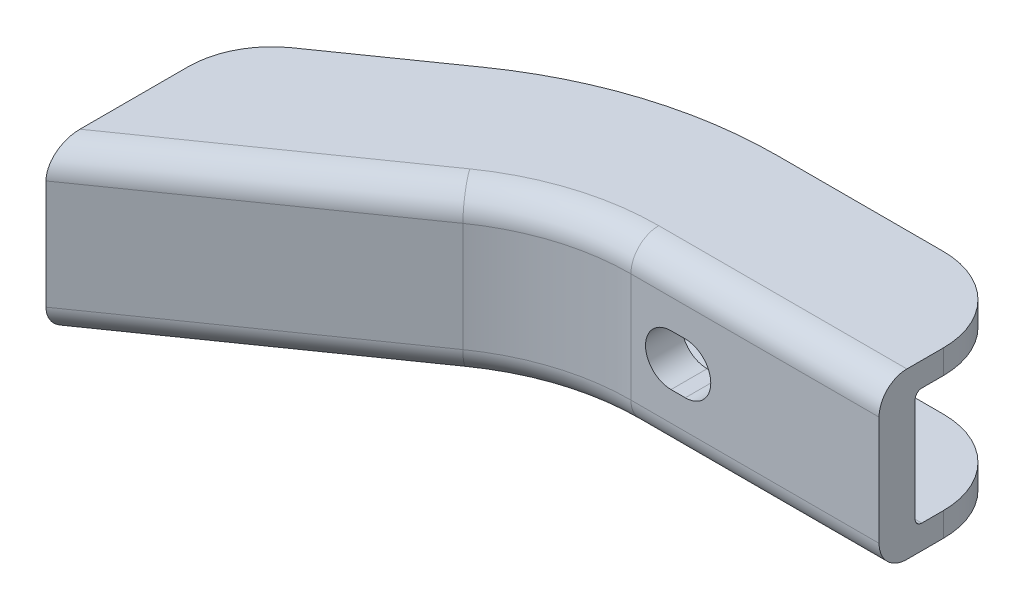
ISO-10303-21;
HEADER;
FILE_DESCRIPTION(('STEP AP214'),'2;1');
FILE_NAME('part.step','',(''),(''),'','','');
FILE_SCHEMA(('AUTOMOTIVE_DESIGN { 1 0 10303 214 1 1 1 1 }'));
ENDSEC;
DATA;
#1=APPLICATION_CONTEXT('core data for automotive mechanical design processes');
#2=APPLICATION_PROTOCOL_DEFINITION('international standard','automotive_design',2000,#1);
#3=PRODUCT_CONTEXT('',#1,'mechanical');
#4=PRODUCT('Part','Part','',(#3));
#5=PRODUCT_RELATED_PRODUCT_CATEGORY('part','',(#4));
#6=PRODUCT_DEFINITION_FORMATION('','',#4);
#7=PRODUCT_DEFINITION_CONTEXT('part definition',#1,'design');
#8=PRODUCT_DEFINITION('design','',#6,#7);
#9=PRODUCT_DEFINITION_SHAPE('','',#8);
#10=(LENGTH_UNIT() NAMED_UNIT(*) SI_UNIT(.MILLI.,.METRE.));
#11=(NAMED_UNIT(*) PLANE_ANGLE_UNIT() SI_UNIT($,.RADIAN.));
#12=(NAMED_UNIT(*) SI_UNIT($,.STERADIAN.) SOLID_ANGLE_UNIT());
#13=UNCERTAINTY_MEASURE_WITH_UNIT(LENGTH_MEASURE(1.E-05),#10,'distance_accuracy_value','');
#14=(GEOMETRIC_REPRESENTATION_CONTEXT(3) GLOBAL_UNCERTAINTY_ASSIGNED_CONTEXT((#13)) GLOBAL_UNIT_ASSIGNED_CONTEXT((#10,
#11,#12)) REPRESENTATION_CONTEXT('',''));
#15=CARTESIAN_POINT('',(0.,0.,0.));
#16=DIRECTION('',(0.,0.,1.));
#17=DIRECTION('',(1.,0.,0.));
#18=AXIS2_PLACEMENT_3D('',#15,#16,#17);
#19=CARTESIAN_POINT('',(0.,2.7432,-7.34059999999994));
#20=DIRECTION('',(-1.,0.,0.));
#21=DIRECTION('',(0.,0.,1.));
#22=AXIS2_PLACEMENT_3D('',#19,#20,#21);
#23=PLANE('',#22);
#24=DIRECTION('',(0.,-1.,0.));
#25=VECTOR('',#24,1.);
#26=CARTESIAN_POINT('',(0.,2.7432,0.));
#27=LINE('',#26,#25);
#28=CARTESIAN_POINT('',(0.,15.6464,0.));
#29=VERTEX_POINT('',#28);
#30=CARTESIAN_POINT('',(0.,3.175,0.));
#31=VERTEX_POINT('',#30);
#32=EDGE_CURVE('E360',#29,#31,#27,.T.);
#33=ORIENTED_EDGE('',*,*,#32,.T.);
#34=CARTESIAN_POINT('',(0.,3.175,-3.175));
#35=DIRECTION('',(-1.,0.,0.));
#36=DIRECTION('',(0.,0.,1.));
#37=AXIS2_PLACEMENT_3D('',#34,#35,#36);
#38=CIRCLE('',#37,3.175);
#39=CARTESIAN_POINT('',(0.,0.,-3.175));
#40=VERTEX_POINT('',#39);
#41=EDGE_CURVE('E456',#31,#40,#38,.F.);
#42=ORIENTED_EDGE('',*,*,#41,.T.);
#43=DIRECTION('',(0.,0.,-1.));
#44=VECTOR('',#43,1.);
#45=CARTESIAN_POINT('',(0.,0.,-7.34059999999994));
#46=LINE('',#45,#44);
#47=CARTESIAN_POINT('',(0.,0.,-7.34059999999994));
#48=VERTEX_POINT('',#47);
#49=EDGE_CURVE('E343',#40,#48,#46,.T.);
#50=ORIENTED_EDGE('',*,*,#49,.T.);
#51=DIRECTION('',(0.,-1.,0.));
#52=VECTOR('',#51,1.);
#53=CARTESIAN_POINT('',(0.,2.7432,-7.34059999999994));
#54=LINE('',#53,#52);
#55=CARTESIAN_POINT('',(0.,2.7432,-7.34059999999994));
#56=VERTEX_POINT('',#55);
#57=EDGE_CURVE('E400',#56,#48,#54,.T.);
#58=ORIENTED_EDGE('',*,*,#57,.F.);
#59=DIRECTION('',(0.,0.,-1.));
#60=VECTOR('',#59,1.);
#61=CARTESIAN_POINT('',(0.,2.7432,-7.34059999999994));
#62=LINE('',#61,#60);
#63=CARTESIAN_POINT('',(0.,2.7432,-4.8768));
#64=VERTEX_POINT('',#63);
#65=EDGE_CURVE('E344',#64,#56,#62,.T.);
#66=ORIENTED_EDGE('',*,*,#65,.F.);
#67=CARTESIAN_POINT('',(0.,3.5052,-4.8768));
#68=DIRECTION('',(-1.,0.,0.));
#69=DIRECTION('',(0.,0.,1.));
#70=AXIS2_PLACEMENT_3D('',#67,#68,#69);
#71=CIRCLE('',#70,0.762);
#72=CARTESIAN_POINT('',(0.,3.5052,-4.1148));
#73=VERTEX_POINT('',#72);
#74=EDGE_CURVE('E433',#64,#73,#71,.T.);
#75=ORIENTED_EDGE('',*,*,#74,.T.);
#76=DIRECTION('',(0.,-1.,0.));
#77=VECTOR('',#76,1.);
#78=CARTESIAN_POINT('',(0.,16.0782,-4.1148));
#79=LINE('',#78,#77);
#80=CARTESIAN_POINT('',(0.,15.3162,-4.1148));
#81=VERTEX_POINT('',#80);
#82=EDGE_CURVE('E340',#81,#73,#79,.T.);
#83=ORIENTED_EDGE('',*,*,#82,.F.);
#84=CARTESIAN_POINT('',(0.,15.3162,-4.8768));
#85=DIRECTION('',(-1.,0.,0.));
#86=DIRECTION('',(0.,0.,1.));
#87=AXIS2_PLACEMENT_3D('',#84,#85,#86);
#88=CIRCLE('',#87,0.762);
#89=CARTESIAN_POINT('',(0.,16.0782,-4.8768));
#90=VERTEX_POINT('',#89);
#91=EDGE_CURVE('E435',#81,#90,#88,.T.);
#92=ORIENTED_EDGE('',*,*,#91,.T.);
#93=DIRECTION('',(0.,0.,-1.));
#94=VECTOR('',#93,1.);
#95=CARTESIAN_POINT('',(0.,16.0782,0.));
#96=LINE('',#95,#94);
#97=CARTESIAN_POINT('',(0.,16.0782,-7.34059999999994));
#98=VERTEX_POINT('',#97);
#99=EDGE_CURVE('E299',#90,#98,#96,.T.);
#100=ORIENTED_EDGE('',*,*,#99,.T.);
#101=DIRECTION('',(0.,-1.,0.));
#102=VECTOR('',#101,1.);
#103=CARTESIAN_POINT('',(0.,18.8214,-7.34059999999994));
#104=LINE('',#103,#102);
#105=CARTESIAN_POINT('',(0.,18.8214,-7.34059999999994));
#106=VERTEX_POINT('',#105);
#107=EDGE_CURVE('E328',#106,#98,#104,.T.);
#108=ORIENTED_EDGE('',*,*,#107,.F.);
#109=DIRECTION('',(0.,0.,-1.));
#110=VECTOR('',#109,1.);
#111=CARTESIAN_POINT('',(0.,18.8214,0.));
#112=LINE('',#111,#110);
#113=CARTESIAN_POINT('',(0.,18.8214,-3.175));
#114=VERTEX_POINT('',#113);
#115=EDGE_CURVE('E282',#114,#106,#112,.T.);
#116=ORIENTED_EDGE('',*,*,#115,.F.);
#117=CARTESIAN_POINT('',(0.,15.6464,-3.175));
#118=DIRECTION('',(-1.,0.,0.));
#119=DIRECTION('',(0.,0.,1.));
#120=AXIS2_PLACEMENT_3D('',#117,#118,#119);
#121=CIRCLE('',#120,3.175);
#122=EDGE_CURVE('E454',#114,#29,#121,.F.);
#123=ORIENTED_EDGE('',*,*,#122,.T.);
#124=EDGE_LOOP('',(#33,#42,#50,#58,#66,#75,#83,#92,#100,#108,#116,#123));
#125=FACE_BOUND('',#124,.T.);
#126=ADVANCED_FACE('F34',(#125),#23,.F.);
#127=CARTESIAN_POINT('',(-9.525,2.7432,-7.34060000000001));
#128=DIRECTION('',(0.,-1.,0.));
#129=DIRECTION('',(0.,0.,-1.));
#130=AXIS2_PLACEMENT_3D('',#127,#128,#129);
#131=CYLINDRICAL_SURFACE('',#130,9.525);
#132=CARTESIAN_POINT('',(-9.525,0.,-7.34060000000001));
#133=DIRECTION('',(0.,1.,0.));
#134=DIRECTION('',(0.,0.,-1.));
#135=AXIS2_PLACEMENT_3D('',#132,#133,#134);
#136=CIRCLE('',#135,9.525);
#137=CARTESIAN_POINT('',(-9.52500000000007,0.,-16.8656));
#138=VERTEX_POINT('',#137);
#139=EDGE_CURVE('E362',#48,#138,#136,.T.);
#140=ORIENTED_EDGE('',*,*,#139,.T.);
#141=DIRECTION('',(0.,-1.,0.));
#142=VECTOR('',#141,1.);
#143=CARTESIAN_POINT('',(-9.52500000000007,2.7432,-16.8656));
#144=LINE('',#143,#142);
#145=CARTESIAN_POINT('',(-9.52500000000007,2.7432,-16.8656));
#146=VERTEX_POINT('',#145);
#147=EDGE_CURVE('E397',#146,#138,#144,.T.);
#148=ORIENTED_EDGE('',*,*,#147,.F.);
#149=CARTESIAN_POINT('',(-9.525,2.7432,-7.34060000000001));
#150=DIRECTION('',(0.,1.,0.));
#151=DIRECTION('',(0.,0.,-1.));
#152=AXIS2_PLACEMENT_3D('',#149,#150,#151);
#153=CIRCLE('',#152,9.525);
#154=EDGE_CURVE('E346',#56,#146,#153,.T.);
#155=ORIENTED_EDGE('',*,*,#154,.F.);
#156=ORIENTED_EDGE('',*,*,#57,.T.);
#157=EDGE_LOOP('',(#140,#148,#155,#156));
#158=FACE_BOUND('',#157,.T.);
#159=ADVANCED_FACE('F570',(#158),#131,.T.);
#160=CARTESIAN_POINT('',(-28.4660595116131,2.7432,-16.8656));
#161=DIRECTION('',(0.,0.,1.));
#162=DIRECTION('',(1.,0.,0.));
#163=AXIS2_PLACEMENT_3D('',#160,#161,#162);
#164=PLANE('',#163);
#165=DIRECTION('',(-1.,0.,0.));
#166=VECTOR('',#165,1.);
#167=CARTESIAN_POINT('',(-28.4660595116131,0.,-16.8656));
#168=LINE('',#167,#166);
#169=CARTESIAN_POINT('',(-28.4660595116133,0.,-16.8656));
#170=VERTEX_POINT('',#169);
#171=EDGE_CURVE('E364',#138,#170,#168,.T.);
#172=ORIENTED_EDGE('',*,*,#171,.T.);
#173=DIRECTION('',(0.,-1.,0.));
#174=VECTOR('',#173,1.);
#175=CARTESIAN_POINT('',(-28.4660595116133,2.7432,-16.8656));
#176=LINE('',#175,#174);
#177=CARTESIAN_POINT('',(-28.4660595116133,2.7432,-16.8656));
#178=VERTEX_POINT('',#177);
#179=EDGE_CURVE('E394',#178,#170,#176,.T.);
#180=ORIENTED_EDGE('',*,*,#179,.F.);
#181=DIRECTION('',(-1.,0.,0.));
#182=VECTOR('',#181,1.);
#183=CARTESIAN_POINT('',(-28.4660595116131,2.7432,-16.8656));
#184=LINE('',#183,#182);
#185=EDGE_CURVE('E349',#146,#178,#184,.T.);
#186=ORIENTED_EDGE('',*,*,#185,.F.);
#187=ORIENTED_EDGE('',*,*,#147,.T.);
#188=EDGE_LOOP('',(#172,#180,#186,#187));
#189=FACE_BOUND('',#188,.T.);
#190=ADVANCED_FACE('F627',(#189),#164,.F.);
#191=CARTESIAN_POINT('',(-28.4660595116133,2.7432,27.5844));
#192=DIRECTION('',(0.,-1.,0.));
#193=DIRECTION('',(0.,0.,-1.));
#194=AXIS2_PLACEMENT_3D('',#191,#192,#193);
#195=CYLINDRICAL_SURFACE('',#194,44.45);
#196=CARTESIAN_POINT('',(-28.4660595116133,0.,27.5844));
#197=DIRECTION('',(0.,1.,0.));
#198=DIRECTION('',(0.,0.,-1.));
#199=AXIS2_PLACEMENT_3D('',#196,#197,#198);
#200=CIRCLE('',#199,44.45);
#201=CARTESIAN_POINT('',(-53.9615321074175,0.,-8.82690836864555));
#202=VERTEX_POINT('',#201);
#203=EDGE_CURVE('E366',#170,#202,#200,.T.);
#204=ORIENTED_EDGE('',*,*,#203,.T.);
#205=DIRECTION('',(0.,-1.,0.));
#206=VECTOR('',#205,1.);
#207=CARTESIAN_POINT('',(-53.9615321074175,2.7432,-8.82690836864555));
#208=LINE('',#207,#206);
#209=CARTESIAN_POINT('',(-53.9615321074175,2.7432,-8.82690836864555));
#210=VERTEX_POINT('',#209);
#211=EDGE_CURVE('E391',#210,#202,#208,.T.);
#212=ORIENTED_EDGE('',*,*,#211,.F.);
#213=CARTESIAN_POINT('',(-28.4660595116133,2.7432,27.5844));
#214=DIRECTION('',(0.,1.,0.));
#215=DIRECTION('',(0.,0.,-1.));
#216=AXIS2_PLACEMENT_3D('',#213,#214,#215);
#217=CIRCLE('',#216,44.45);
#218=EDGE_CURVE('E351',#178,#210,#217,.T.);
#219=ORIENTED_EDGE('',*,*,#218,.F.);
#220=ORIENTED_EDGE('',*,*,#179,.T.);
#221=EDGE_LOOP('',(#204,#212,#219,#220));
#222=FACE_BOUND('',#221,.T.);
#223=ADVANCED_FACE('F623',(#222),#195,.T.);
#224=CARTESIAN_POINT('',(-66.7990423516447,2.7432,0.162013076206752));
#225=DIRECTION('',(0.573576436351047,0.,0.819152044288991));
#226=DIRECTION('',(0.819152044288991,0.,-0.573576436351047));
#227=AXIS2_PLACEMENT_3D('',#224,#225,#226);
#228=PLANE('',#227);
#229=DIRECTION('',(-0.819152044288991,0.,0.573576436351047));
#230=VECTOR('',#229,1.);
#231=CARTESIAN_POINT('',(-66.7990423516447,0.,0.162013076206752));
#232=LINE('',#231,#230);
#233=CARTESIAN_POINT('',(-66.7990423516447,0.,0.162013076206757));
#234=VERTEX_POINT('',#233);
#235=EDGE_CURVE('E368',#202,#234,#232,.T.);
#236=ORIENTED_EDGE('',*,*,#235,.T.);
#237=DIRECTION('',(0.,-1.,0.));
#238=VECTOR('',#237,1.);
#239=CARTESIAN_POINT('',(-66.7990423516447,2.7432,0.162013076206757));
#240=LINE('',#239,#238);
#241=CARTESIAN_POINT('',(-66.7990423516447,2.7432,0.162013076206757));
#242=VERTEX_POINT('',#241);
#243=EDGE_CURVE('E388',#242,#234,#240,.T.);
#244=ORIENTED_EDGE('',*,*,#243,.F.);
#245=DIRECTION('',(-0.819152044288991,0.,0.573576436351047));
#246=VECTOR('',#245,1.);
#247=CARTESIAN_POINT('',(-66.7990423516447,2.7432,0.162013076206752));
#248=LINE('',#247,#246);
#249=EDGE_CURVE('E353',#210,#242,#248,.T.);
#250=ORIENTED_EDGE('',*,*,#249,.F.);
#251=ORIENTED_EDGE('',*,*,#211,.T.);
#252=EDGE_LOOP('',(#236,#244,#250,#251));
#253=FACE_BOUND('',#252,.T.);
#254=ADVANCED_FACE('F619',(#253),#228,.F.);
#255=CARTESIAN_POINT('',(-61.335726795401,2.7432,7.96443629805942));
#256=DIRECTION('',(0.,-1.,0.));
#257=DIRECTION('',(0.,0.,-1.));
#258=AXIS2_PLACEMENT_3D('',#255,#256,#257);
#259=CYLINDRICAL_SURFACE('',#258,9.525);
#260=CARTESIAN_POINT('',(-61.335726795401,0.,7.96443629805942));
#261=DIRECTION('',(0.,1.,0.));
#262=DIRECTION('',(0.,0.,-1.));
#263=AXIS2_PLACEMENT_3D('',#260,#261,#262);
#264=CIRCLE('',#263,9.525);
#265=CARTESIAN_POINT('',(-70.860726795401,0.,7.96443629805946));
#266=VERTEX_POINT('',#265);
#267=EDGE_CURVE('E370',#234,#266,#264,.T.);
#268=ORIENTED_EDGE('',*,*,#267,.T.);
#269=DIRECTION('',(0.,-1.,0.));
#270=VECTOR('',#269,1.);
#271=CARTESIAN_POINT('',(-70.860726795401,2.7432,7.96443629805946));
#272=LINE('',#271,#270);
#273=CARTESIAN_POINT('',(-70.860726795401,2.7432,7.96443629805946));
#274=VERTEX_POINT('',#273);
#275=EDGE_CURVE('E385',#274,#266,#272,.T.);
#276=ORIENTED_EDGE('',*,*,#275,.F.);
#277=CARTESIAN_POINT('',(-61.335726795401,2.7432,7.96443629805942));
#278=DIRECTION('',(0.,1.,0.));
#279=DIRECTION('',(0.,0.,-1.));
#280=AXIS2_PLACEMENT_3D('',#277,#278,#279);
#281=CIRCLE('',#280,9.525);
#282=EDGE_CURVE('E355',#242,#274,#281,.T.);
#283=ORIENTED_EDGE('',*,*,#282,.F.);
#284=ORIENTED_EDGE('',*,*,#243,.T.);
#285=EDGE_LOOP('',(#268,#276,#283,#284));
#286=FACE_BOUND('',#285,.T.);
#287=ADVANCED_FACE('F614',(#286),#259,.T.);
#288=CARTESIAN_POINT('',(-70.860726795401,2.7432,24.1842768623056));
#289=DIRECTION('',(1.,0.,0.));
#290=DIRECTION('',(0.,0.,-1.));
#291=AXIS2_PLACEMENT_3D('',#288,#289,#290);
#292=PLANE('',#291);
#293=DIRECTION('',(0.,-1.,0.));
#294=VECTOR('',#293,1.);
#295=CARTESIAN_POINT('',(-70.860726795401,2.7432,24.1842768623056));
#296=LINE('',#295,#294);
#297=CARTESIAN_POINT('',(-70.860726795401,15.6464,24.1842768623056));
#298=VERTEX_POINT('',#297);
#299=CARTESIAN_POINT('',(-70.860726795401,3.175,24.1842768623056));
#300=VERTEX_POINT('',#299);
#301=EDGE_CURVE('E382',#298,#300,#296,.T.);
#302=ORIENTED_EDGE('',*,*,#301,.F.);
#303=CARTESIAN_POINT('',(-70.860726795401,15.6464,20.3083175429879));
#304=DIRECTION('',(1.,0.,0.));
#305=DIRECTION('',(0.,0.,1.));
#306=AXIS2_PLACEMENT_3D('',#303,#304,#305);
#307=ELLIPSE('',#306,3.87595931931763,3.175);
#308=CARTESIAN_POINT('',(-70.860726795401,18.8214,20.3083175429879));
#309=VERTEX_POINT('',#308);
#310=EDGE_CURVE('E11',#298,#309,#307,.F.);
#311=ORIENTED_EDGE('',*,*,#310,.T.);
#312=DIRECTION('',(0.,0.,1.));
#313=VECTOR('',#312,1.);
#314=CARTESIAN_POINT('',(-70.860726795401,18.8214,7.96443629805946));
#315=LINE('',#314,#313);
#316=CARTESIAN_POINT('',(-70.860726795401,18.8214,7.96443629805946));
#317=VERTEX_POINT('',#316);
#318=EDGE_CURVE('E295',#317,#309,#315,.T.);
#319=ORIENTED_EDGE('',*,*,#318,.F.);
#320=DIRECTION('',(0.,-1.,0.));
#321=VECTOR('',#320,1.);
#322=CARTESIAN_POINT('',(-70.860726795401,18.8214,7.96443629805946));
#323=LINE('',#322,#321);
#324=CARTESIAN_POINT('',(-70.860726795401,16.0782,7.96443629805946));
#325=VERTEX_POINT('',#324);
#326=EDGE_CURVE('E298',#317,#325,#323,.T.);
#327=ORIENTED_EDGE('',*,*,#326,.T.);
#328=DIRECTION('',(0.,0.,1.));
#329=VECTOR('',#328,1.);
#330=CARTESIAN_POINT('',(-70.860726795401,16.0782,7.96443629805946));
#331=LINE('',#330,#329);
#332=CARTESIAN_POINT('',(-70.860726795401,16.0782,18.2308033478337));
#333=VERTEX_POINT('',#332);
#334=EDGE_CURVE('E285',#325,#333,#331,.T.);
#335=ORIENTED_EDGE('',*,*,#334,.T.);
#336=CARTESIAN_POINT('',(-70.860726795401,15.3162,18.2308033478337));
#337=DIRECTION('',(1.,0.,0.));
#338=DIRECTION('',(0.,0.,-1.));
#339=AXIS2_PLACEMENT_3D('',#336,#337,#338);
#340=ELLIPSE('',#339,0.93023023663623,0.762);
#341=CARTESIAN_POINT('',(-70.860726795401,15.3162,19.1610335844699));
#342=VERTEX_POINT('',#341);
#343=EDGE_CURVE('E431',#333,#342,#340,.T.);
#344=ORIENTED_EDGE('',*,*,#343,.T.);
#345=DIRECTION('',(0.,-1.,0.));
#346=VECTOR('',#345,1.);
#347=CARTESIAN_POINT('',(-70.860726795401,16.0782,19.1610335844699));
#348=LINE('',#347,#346);
#349=CARTESIAN_POINT('',(-70.860726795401,3.5052,19.1610335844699));
#350=VERTEX_POINT('',#349);
#351=EDGE_CURVE('E331',#342,#350,#348,.T.);
#352=ORIENTED_EDGE('',*,*,#351,.T.);
#353=CARTESIAN_POINT('',(-70.860726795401,3.5052,18.2308033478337));
#354=DIRECTION('',(1.,0.,0.));
#355=DIRECTION('',(0.,0.,1.));
#356=AXIS2_PLACEMENT_3D('',#353,#354,#355);
#357=ELLIPSE('',#356,0.93023023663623,0.762);
#358=CARTESIAN_POINT('',(-70.860726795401,2.7432,18.2308033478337));
#359=VERTEX_POINT('',#358);
#360=EDGE_CURVE('E429',#350,#359,#357,.T.);
#361=ORIENTED_EDGE('',*,*,#360,.T.);
#362=DIRECTION('',(0.,0.,1.));
#363=VECTOR('',#362,1.);
#364=CARTESIAN_POINT('',(-70.860726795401,2.7432,24.1842768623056));
#365=LINE('',#364,#363);
#366=EDGE_CURVE('E357',#274,#359,#365,.T.);
#367=ORIENTED_EDGE('',*,*,#366,.F.);
#368=ORIENTED_EDGE('',*,*,#275,.T.);
#369=DIRECTION('',(0.,0.,1.));
#370=VECTOR('',#369,1.);
#371=CARTESIAN_POINT('',(-70.860726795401,0.,24.1842768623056));
#372=LINE('',#371,#370);
#373=CARTESIAN_POINT('',(-70.860726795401,0.,20.3083175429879));
#374=VERTEX_POINT('',#373);
#375=EDGE_CURVE('E347',#266,#374,#372,.T.);
#376=ORIENTED_EDGE('',*,*,#375,.T.);
#377=CARTESIAN_POINT('',(-70.860726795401,3.175,20.3083175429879));
#378=DIRECTION('',(1.,0.,0.));
#379=DIRECTION('',(0.,0.,-1.));
#380=AXIS2_PLACEMENT_3D('',#377,#378,#379);
#381=ELLIPSE('',#380,3.87595931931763,3.175);
#382=EDGE_CURVE('E43',#374,#300,#381,.F.);
#383=ORIENTED_EDGE('',*,*,#382,.T.);
#384=EDGE_LOOP('',(#302,#311,#319,#327,#335,#344,#352,#361,#367,#368,#376,#383));
#385=FACE_BOUND('',#384,.T.);
#386=ADVANCED_FACE('F534',(#385),#292,.F.);
#387=CARTESIAN_POINT('',(-42.8822522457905,2.7432,4.59353807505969));
#388=DIRECTION('',(-0.573576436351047,0.,-0.819152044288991));
#389=DIRECTION('',(-0.819152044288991,0.,0.573576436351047));
#390=AXIS2_PLACEMENT_3D('',#387,#388,#389);
#391=PLANE('',#390);
#392=DIRECTION('',(0.,-1.,0.));
#393=VECTOR('',#392,1.);
#394=CARTESIAN_POINT('',(-42.8822522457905,2.7432,4.59353807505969));
#395=LINE('',#394,#393);
#396=CARTESIAN_POINT('',(-42.8822522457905,15.6464,4.59353807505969));
#397=VERTEX_POINT('',#396);
#398=CARTESIAN_POINT('',(-42.8822522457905,3.175,4.59353807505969));
#399=VERTEX_POINT('',#398);
#400=EDGE_CURVE('E379',#397,#399,#395,.T.);
#401=ORIENTED_EDGE('',*,*,#400,.F.);
#402=DIRECTION('',(0.819152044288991,0.,-0.573576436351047));
#403=VECTOR('',#402,1.);
#404=CARTESIAN_POINT('',(-70.860726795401,15.6464,24.1842768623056));
#405=LINE('',#404,#403);
#406=EDGE_CURVE('E477',#397,#298,#405,.F.);
#407=ORIENTED_EDGE('',*,*,#406,.T.);
#408=ORIENTED_EDGE('',*,*,#301,.T.);
#409=DIRECTION('',(0.819152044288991,0.,-0.573576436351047));
#410=VECTOR('',#409,1.);
#411=CARTESIAN_POINT('',(-42.8822522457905,3.175,4.59353807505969));
#412=LINE('',#411,#410);
#413=EDGE_CURVE('E475',#300,#399,#412,.T.);
#414=ORIENTED_EDGE('',*,*,#413,.T.);
#415=EDGE_LOOP('',(#401,#407,#408,#414));
#416=FACE_BOUND('',#415,.T.);
#417=ADVANCED_FACE('F539',(#416),#391,.F.);
#418=CARTESIAN_POINT('',(-28.3134107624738,2.7432,25.4));
#419=DIRECTION('',(0.,-1.,0.));
#420=DIRECTION('',(0.,0.,-1.));
#421=AXIS2_PLACEMENT_3D('',#418,#419,#420);
#422=CYLINDRICAL_SURFACE('',#421,25.4);
#423=ORIENTED_EDGE('',*,*,#400,.T.);
#424=CARTESIAN_POINT('',(-28.3134107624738,3.175,25.4));
#425=DIRECTION('',(0.,1.,0.));
#426=DIRECTION('',(0.,0.,1.));
#427=AXIS2_PLACEMENT_3D('',#424,#425,#426);
#428=CIRCLE('',#427,25.4);
#429=CARTESIAN_POINT('',(-28.3134107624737,3.175,0.));
#430=VERTEX_POINT('',#429);
#431=EDGE_CURVE('E466',#399,#430,#428,.F.);
#432=ORIENTED_EDGE('',*,*,#431,.T.);
#433=DIRECTION('',(0.,-1.,0.));
#434=VECTOR('',#433,1.);
#435=CARTESIAN_POINT('',(-28.3134107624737,2.7432,0.));
#436=LINE('',#435,#434);
#437=CARTESIAN_POINT('',(-28.3134107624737,15.6464,0.));
#438=VERTEX_POINT('',#437);
#439=EDGE_CURVE('E376',#438,#430,#436,.T.);
#440=ORIENTED_EDGE('',*,*,#439,.F.);
#441=CARTESIAN_POINT('',(-28.3134107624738,15.6464,25.4));
#442=DIRECTION('',(0.,1.,0.));
#443=DIRECTION('',(0.,0.,1.));
#444=AXIS2_PLACEMENT_3D('',#441,#442,#443);
#445=CIRCLE('',#444,25.4);
#446=EDGE_CURVE('E464',#438,#397,#445,.T.);
#447=ORIENTED_EDGE('',*,*,#446,.T.);
#448=EDGE_LOOP('',(#423,#432,#440,#447));
#449=FACE_BOUND('',#448,.T.);
#450=ADVANCED_FACE('F543',(#449),#422,.F.);
#451=CARTESIAN_POINT('',(0.,2.7432,0.));
#452=DIRECTION('',(0.,0.,-1.));
#453=DIRECTION('',(-1.,0.,0.));
#454=AXIS2_PLACEMENT_3D('',#451,#452,#453);
#455=PLANE('',#454);
#456=DIRECTION('',(1.,0.,0.));
#457=VECTOR('',#456,1.);
#458=CARTESIAN_POINT('',(0.,12.319,0.));
#459=LINE('',#458,#457);
#460=CARTESIAN_POINT('',(-23.7363,12.319,0.));
#461=VERTEX_POINT('',#460);
#462=CARTESIAN_POINT('',(-22.1107,12.319,0.));
#463=VERTEX_POINT('',#462);
#464=EDGE_CURVE('E275',#461,#463,#459,.T.);
#465=ORIENTED_EDGE('',*,*,#464,.T.);
#466=CARTESIAN_POINT('',(-22.1107,9.4107,0.));
#467=DIRECTION('',(0.,0.,-1.));
#468=DIRECTION('',(-1.,0.,0.));
#469=AXIS2_PLACEMENT_3D('',#466,#467,#468);
#470=CIRCLE('',#469,2.9083);
#471=CARTESIAN_POINT('',(-22.1107,6.5024,0.));
#472=VERTEX_POINT('',#471);
#473=EDGE_CURVE('E278',#463,#472,#470,.T.);
#474=ORIENTED_EDGE('',*,*,#473,.T.);
#475=DIRECTION('',(-1.,0.,0.));
#476=VECTOR('',#475,1.);
#477=CARTESIAN_POINT('',(0.,6.5024,0.));
#478=LINE('',#477,#476);
#479=CARTESIAN_POINT('',(-23.7363,6.5024,0.));
#480=VERTEX_POINT('',#479);
#481=EDGE_CURVE('E270',#472,#480,#478,.T.);
#482=ORIENTED_EDGE('',*,*,#481,.T.);
#483=CARTESIAN_POINT('',(-23.7363,9.4107,0.));
#484=DIRECTION('',(0.,0.,-1.));
#485=DIRECTION('',(-1.,0.,0.));
#486=AXIS2_PLACEMENT_3D('',#483,#484,#485);
#487=CIRCLE('',#486,2.9083);
#488=EDGE_CURVE('E250',#480,#461,#487,.T.);
#489=ORIENTED_EDGE('',*,*,#488,.T.);
#490=EDGE_LOOP('',(#465,#474,#482,#489));
#491=FACE_BOUND('',#490,.T.);
#492=ORIENTED_EDGE('',*,*,#439,.T.);
#493=DIRECTION('',(1.,0.,0.));
#494=VECTOR('',#493,1.);
#495=CARTESIAN_POINT('',(0.,3.175,0.));
#496=LINE('',#495,#494);
#497=EDGE_CURVE('E451',#430,#31,#496,.T.);
#498=ORIENTED_EDGE('',*,*,#497,.T.);
#499=ORIENTED_EDGE('',*,*,#32,.F.);
#500=DIRECTION('',(1.,0.,0.));
#501=VECTOR('',#500,1.);
#502=CARTESIAN_POINT('',(-28.3134107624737,15.6464,0.));
#503=LINE('',#502,#501);
#504=EDGE_CURVE('E437',#29,#438,#503,.F.);
#505=ORIENTED_EDGE('',*,*,#504,.T.);
#506=EDGE_LOOP('',(#492,#498,#499,#505));
#507=FACE_BOUND('',#506,.T.);
#508=ADVANCED_FACE('F559',(#491,#507),#455,.F.);
#509=CARTESIAN_POINT('',(-28.3134107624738,2.7432,25.4));
#510=DIRECTION('',(0.,1.,0.));
#511=DIRECTION('',(0.,0.,1.));
#512=AXIS2_PLACEMENT_3D('',#509,#510,#511);
#513=PLANE('',#512);
#514=ORIENTED_EDGE('',*,*,#366,.T.);
#515=DIRECTION('',(-0.819152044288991,0.,0.573576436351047));
#516=VECTOR('',#515,1.);
#517=CARTESIAN_POINT('',(-45.6794698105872,2.7432,0.598697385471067));
#518=LINE('',#517,#516);
#519=CARTESIAN_POINT('',(-45.6794698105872,2.7432,0.598697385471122));
#520=VERTEX_POINT('',#519);
#521=EDGE_CURVE('E412',#359,#520,#518,.F.);
#522=ORIENTED_EDGE('',*,*,#521,.T.);
#523=CARTESIAN_POINT('',(-28.3134107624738,2.7432,25.4));
#524=DIRECTION('',(0.,1.,0.));
#525=DIRECTION('',(0.,0.,1.));
#526=AXIS2_PLACEMENT_3D('',#523,#524,#525);
#527=CIRCLE('',#526,30.2768);
#528=CARTESIAN_POINT('',(-28.3134107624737,2.7432,-4.8768));
#529=VERTEX_POINT('',#528);
#530=EDGE_CURVE('E410',#520,#529,#527,.F.);
#531=ORIENTED_EDGE('',*,*,#530,.T.);
#532=DIRECTION('',(-1.,0.,0.));
#533=VECTOR('',#532,1.);
#534=CARTESIAN_POINT('',(-28.3134107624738,2.7432,-4.8768));
#535=LINE('',#534,#533);
#536=EDGE_CURVE('E408',#529,#64,#535,.F.);
#537=ORIENTED_EDGE('',*,*,#536,.T.);
#538=ORIENTED_EDGE('',*,*,#65,.T.);
#539=ORIENTED_EDGE('',*,*,#154,.T.);
#540=ORIENTED_EDGE('',*,*,#185,.T.);
#541=ORIENTED_EDGE('',*,*,#218,.T.);
#542=ORIENTED_EDGE('',*,*,#249,.T.);
#543=ORIENTED_EDGE('',*,*,#282,.T.);
#544=EDGE_LOOP('',(#514,#522,#531,#537,#538,#539,#540,#541,#542,#543));
#545=FACE_BOUND('',#544,.T.);
#546=ADVANCED_FACE('F607',(#545),#513,.T.);
#547=CARTESIAN_POINT('',(-28.3134107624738,0.,25.4));
#548=DIRECTION('',(0.,1.,0.));
#549=DIRECTION('',(0.,0.,1.));
#550=AXIS2_PLACEMENT_3D('',#547,#548,#549);
#551=PLANE('',#550);
#552=ORIENTED_EDGE('',*,*,#49,.F.);
#553=DIRECTION('',(1.,0.,0.));
#554=VECTOR('',#553,1.);
#555=CARTESIAN_POINT('',(-28.3134107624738,0.,-3.175));
#556=LINE('',#555,#554);
#557=CARTESIAN_POINT('',(-28.3134107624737,0.,-3.175));
#558=VERTEX_POINT('',#557);
#559=EDGE_CURVE('E462',#40,#558,#556,.F.);
#560=ORIENTED_EDGE('',*,*,#559,.T.);
#561=CARTESIAN_POINT('',(-28.3134107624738,0.,25.4));
#562=DIRECTION('',(0.,1.,0.));
#563=DIRECTION('',(0.,0.,1.));
#564=AXIS2_PLACEMENT_3D('',#561,#562,#563);
#565=CIRCLE('',#564,28.575);
#566=CARTESIAN_POINT('',(-44.7033574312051,0.,1.99273033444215));
#567=VERTEX_POINT('',#566);
#568=EDGE_CURVE('E460',#558,#567,#565,.T.);
#569=ORIENTED_EDGE('',*,*,#568,.T.);
#570=DIRECTION('',(0.819152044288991,0.,-0.573576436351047));
#571=VECTOR('',#570,1.);
#572=CARTESIAN_POINT('',(-44.703357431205,0.,1.99273033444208));
#573=LINE('',#572,#571);
#574=EDGE_CURVE('E458',#567,#374,#573,.F.);
#575=ORIENTED_EDGE('',*,*,#574,.T.);
#576=ORIENTED_EDGE('',*,*,#375,.F.);
#577=ORIENTED_EDGE('',*,*,#267,.F.);
#578=ORIENTED_EDGE('',*,*,#235,.F.);
#579=ORIENTED_EDGE('',*,*,#203,.F.);
#580=ORIENTED_EDGE('',*,*,#171,.F.);
#581=ORIENTED_EDGE('',*,*,#139,.F.);
#582=EDGE_LOOP('',(#552,#560,#569,#575,#576,#577,#578,#579,#580,#581));
#583=FACE_BOUND('',#582,.T.);
#584=ADVANCED_FACE('F564',(#583),#551,.F.);
#585=CARTESIAN_POINT('',(-28.3134107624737,16.0782,-4.1148));
#586=DIRECTION('',(0.,0.,1.));
#587=DIRECTION('',(1.,0.,0.));
#588=AXIS2_PLACEMENT_3D('',#585,#586,#587);
#589=PLANE('',#588);
#590=DIRECTION('',(-1.,0.,0.));
#591=VECTOR('',#590,1.);
#592=CARTESIAN_POINT('',(-22.1107,6.5024,-4.1148));
#593=LINE('',#592,#591);
#594=CARTESIAN_POINT('',(-22.1107,6.5024,-4.1148));
#595=VERTEX_POINT('',#594);
#596=CARTESIAN_POINT('',(-23.7363,6.5024,-4.1148));
#597=VERTEX_POINT('',#596);
#598=EDGE_CURVE('E256',#595,#597,#593,.T.);
#599=ORIENTED_EDGE('',*,*,#598,.F.);
#600=CARTESIAN_POINT('',(-22.1107,9.4107,-4.1148));
#601=DIRECTION('',(0.,0.,-1.));
#602=DIRECTION('',(-1.,0.,0.));
#603=AXIS2_PLACEMENT_3D('',#600,#601,#602);
#604=CIRCLE('',#603,2.9083);
#605=CARTESIAN_POINT('',(-22.1107,12.319,-4.1148));
#606=VERTEX_POINT('',#605);
#607=EDGE_CURVE('E59',#606,#595,#604,.T.);
#608=ORIENTED_EDGE('',*,*,#607,.F.);
#609=DIRECTION('',(1.,0.,0.));
#610=VECTOR('',#609,1.);
#611=CARTESIAN_POINT('',(-22.1107,12.319,-4.1148));
#612=LINE('',#611,#610);
#613=CARTESIAN_POINT('',(-23.7363,12.319,-4.1148));
#614=VERTEX_POINT('',#613);
#615=EDGE_CURVE('E263',#614,#606,#612,.T.);
#616=ORIENTED_EDGE('',*,*,#615,.F.);
#617=CARTESIAN_POINT('',(-23.7363,9.4107,-4.1148));
#618=DIRECTION('',(0.,0.,-1.));
#619=DIRECTION('',(-1.,0.,0.));
#620=AXIS2_PLACEMENT_3D('',#617,#618,#619);
#621=CIRCLE('',#620,2.9083);
#622=EDGE_CURVE('E247',#597,#614,#621,.T.);
#623=ORIENTED_EDGE('',*,*,#622,.F.);
#624=EDGE_LOOP('',(#599,#608,#616,#623));
#625=FACE_BOUND('',#624,.T.);
#626=ORIENTED_EDGE('',*,*,#82,.T.);
#627=DIRECTION('',(-1.,0.,0.));
#628=VECTOR('',#627,1.);
#629=CARTESIAN_POINT('',(-28.3134107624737,3.5052,-4.1148));
#630=LINE('',#629,#628);
#631=CARTESIAN_POINT('',(-28.3134107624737,3.5052,-4.1148));
#632=VERTEX_POINT('',#631);
#633=EDGE_CURVE('E427',#73,#632,#630,.T.);
#634=ORIENTED_EDGE('',*,*,#633,.T.);
#635=DIRECTION('',(0.,-1.,0.));
#636=VECTOR('',#635,1.);
#637=CARTESIAN_POINT('',(-28.3134107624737,16.0782,-4.1148));
#638=LINE('',#637,#636);
#639=CARTESIAN_POINT('',(-28.3134107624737,15.3162,-4.1148));
#640=VERTEX_POINT('',#639);
#641=EDGE_CURVE('E337',#640,#632,#638,.T.);
#642=ORIENTED_EDGE('',*,*,#641,.F.);
#643=DIRECTION('',(-1.,0.,0.));
#644=VECTOR('',#643,1.);
#645=CARTESIAN_POINT('',(0.,15.3162,-4.1148));
#646=LINE('',#645,#644);
#647=EDGE_CURVE('E425',#640,#81,#646,.F.);
#648=ORIENTED_EDGE('',*,*,#647,.T.);
#649=EDGE_LOOP('',(#626,#634,#642,#648));
#650=FACE_BOUND('',#649,.T.);
#651=ADVANCED_FACE('F260',(#625,#650),#589,.F.);
#652=CARTESIAN_POINT('',(-28.3134107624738,16.0782,25.4));
#653=DIRECTION('',(0.,-1.,0.));
#654=DIRECTION('',(0.,0.,-1.));
#655=AXIS2_PLACEMENT_3D('',#652,#653,#654);
#656=CYLINDRICAL_SURFACE('',#655,29.5148);
#657=ORIENTED_EDGE('',*,*,#641,.T.);
#658=CARTESIAN_POINT('',(-28.3134107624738,3.5052,25.4));
#659=DIRECTION('',(0.,1.,0.));
#660=DIRECTION('',(0.,0.,1.));
#661=AXIS2_PLACEMENT_3D('',#658,#659,#660);
#662=CIRCLE('',#661,29.5148);
#663=CARTESIAN_POINT('',(-45.2424045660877,3.5052,1.22289124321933));
#664=VERTEX_POINT('',#663);
#665=EDGE_CURVE('E416',#632,#664,#662,.T.);
#666=ORIENTED_EDGE('',*,*,#665,.T.);
#667=DIRECTION('',(0.,-1.,0.));
#668=VECTOR('',#667,1.);
#669=CARTESIAN_POINT('',(-45.2424045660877,16.0782,1.22289124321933));
#670=LINE('',#669,#668);
#671=CARTESIAN_POINT('',(-45.2424045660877,15.3162,1.22289124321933));
#672=VERTEX_POINT('',#671);
#673=EDGE_CURVE('E334',#672,#664,#670,.T.);
#674=ORIENTED_EDGE('',*,*,#673,.F.);
#675=CARTESIAN_POINT('',(-28.3134107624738,15.3162,25.4));
#676=DIRECTION('',(0.,1.,0.));
#677=DIRECTION('',(0.,0.,1.));
#678=AXIS2_PLACEMENT_3D('',#675,#676,#677);
#679=CIRCLE('',#678,29.5148);
#680=EDGE_CURVE('E414',#672,#640,#679,.F.);
#681=ORIENTED_EDGE('',*,*,#680,.T.);
#682=EDGE_LOOP('',(#657,#666,#674,#681));
#683=FACE_BOUND('',#682,.T.);
#684=ADVANCED_FACE('F584',(#683),#656,.T.);
#685=CARTESIAN_POINT('',(-70.860726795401,16.0782,19.1610335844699));
#686=DIRECTION('',(0.573576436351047,0.,0.819152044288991));
#687=DIRECTION('',(0.819152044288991,0.,-0.573576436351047));
#688=AXIS2_PLACEMENT_3D('',#685,#686,#687);
#689=PLANE('',#688);
#690=ORIENTED_EDGE('',*,*,#673,.T.);
#691=DIRECTION('',(-0.819152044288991,0.,0.573576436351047));
#692=VECTOR('',#691,1.);
#693=CARTESIAN_POINT('',(-70.860726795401,3.5052,19.1610335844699));
#694=LINE('',#693,#692);
#695=EDGE_CURVE('E405',#664,#350,#694,.T.);
#696=ORIENTED_EDGE('',*,*,#695,.T.);
#697=ORIENTED_EDGE('',*,*,#351,.F.);
#698=DIRECTION('',(-0.819152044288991,0.,0.573576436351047));
#699=VECTOR('',#698,1.);
#700=CARTESIAN_POINT('',(-45.2424045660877,15.3162,1.22289124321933));
#701=LINE('',#700,#699);
#702=EDGE_CURVE('E403',#342,#672,#701,.F.);
#703=ORIENTED_EDGE('',*,*,#702,.T.);
#704=EDGE_LOOP('',(#690,#696,#697,#703));
#705=FACE_BOUND('',#704,.T.);
#706=ADVANCED_FACE('F600',(#705),#689,.F.);
#707=CARTESIAN_POINT('',(-28.3134107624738,16.0782,25.4));
#708=DIRECTION('',(0.,1.,0.));
#709=DIRECTION('',(0.,0.,1.));
#710=AXIS2_PLACEMENT_3D('',#707,#708,#709);
#711=PLANE('',#710);
#712=CARTESIAN_POINT('',(-28.3134107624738,16.0782,25.4));
#713=DIRECTION('',(0.,1.,0.));
#714=DIRECTION('',(0.,0.,1.));
#715=AXIS2_PLACEMENT_3D('',#712,#713,#714);
#716=CIRCLE('',#715,30.2768);
#717=CARTESIAN_POINT('',(-28.3134107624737,16.0782,-4.8768));
#718=VERTEX_POINT('',#717);
#719=CARTESIAN_POINT('',(-45.6794698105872,16.0782,0.598697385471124));
#720=VERTEX_POINT('',#719);
#721=EDGE_CURVE('E420',#718,#720,#716,.T.);
#722=ORIENTED_EDGE('',*,*,#721,.T.);
#723=DIRECTION('',(-0.819152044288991,0.,0.573576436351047));
#724=VECTOR('',#723,1.);
#725=CARTESIAN_POINT('',(-71.2977920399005,16.0782,18.5368397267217));
#726=LINE('',#725,#724);
#727=EDGE_CURVE('E422',#720,#333,#726,.T.);
#728=ORIENTED_EDGE('',*,*,#727,.T.);
#729=ORIENTED_EDGE('',*,*,#334,.F.);
#730=CARTESIAN_POINT('',(-61.335726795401,16.0782,7.96443629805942));
#731=DIRECTION('',(0.,1.,0.));
#732=DIRECTION('',(0.,0.,1.));
#733=AXIS2_PLACEMENT_3D('',#730,#731,#732);
#734=CIRCLE('',#733,9.525);
#735=CARTESIAN_POINT('',(-66.7990423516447,16.0782,0.162013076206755));
#736=VERTEX_POINT('',#735);
#737=EDGE_CURVE('E310',#736,#325,#734,.T.);
#738=ORIENTED_EDGE('',*,*,#737,.F.);
#739=DIRECTION('',(-0.819152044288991,0.,0.573576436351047));
#740=VECTOR('',#739,1.);
#741=CARTESIAN_POINT('',(-53.9615321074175,16.0782,-8.82690836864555));
#742=LINE('',#741,#740);
#743=CARTESIAN_POINT('',(-53.9615321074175,16.0782,-8.82690836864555));
#744=VERTEX_POINT('',#743);
#745=EDGE_CURVE('E308',#744,#736,#742,.T.);
#746=ORIENTED_EDGE('',*,*,#745,.F.);
#747=CARTESIAN_POINT('',(-28.4660595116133,16.0782,27.5844));
#748=DIRECTION('',(0.,1.,0.));
#749=DIRECTION('',(0.,0.,1.));
#750=AXIS2_PLACEMENT_3D('',#747,#748,#749);
#751=CIRCLE('',#750,44.45);
#752=CARTESIAN_POINT('',(-28.4660595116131,16.0782,-16.8656));
#753=VERTEX_POINT('',#752);
#754=EDGE_CURVE('E306',#753,#744,#751,.T.);
#755=ORIENTED_EDGE('',*,*,#754,.F.);
#756=DIRECTION('',(-1.,0.,0.));
#757=VECTOR('',#756,1.);
#758=CARTESIAN_POINT('',(-9.52500000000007,16.0782,-16.8656));
#759=LINE('',#758,#757);
#760=CARTESIAN_POINT('',(-9.52500000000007,16.0782,-16.8656));
#761=VERTEX_POINT('',#760);
#762=EDGE_CURVE('E304',#761,#753,#759,.T.);
#763=ORIENTED_EDGE('',*,*,#762,.F.);
#764=CARTESIAN_POINT('',(-9.525,16.0782,-7.34060000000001));
#765=DIRECTION('',(0.,1.,0.));
#766=DIRECTION('',(0.,0.,1.));
#767=AXIS2_PLACEMENT_3D('',#764,#765,#766);
#768=CIRCLE('',#767,9.525);
#769=EDGE_CURVE('E301',#98,#761,#768,.T.);
#770=ORIENTED_EDGE('',*,*,#769,.F.);
#771=ORIENTED_EDGE('',*,*,#99,.F.);
#772=DIRECTION('',(-1.,0.,0.));
#773=VECTOR('',#772,1.);
#774=CARTESIAN_POINT('',(-28.3134107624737,16.0782,-4.8768));
#775=LINE('',#774,#773);
#776=EDGE_CURVE('E418',#90,#718,#775,.T.);
#777=ORIENTED_EDGE('',*,*,#776,.T.);
#778=EDGE_LOOP('',(#722,#728,#729,#738,#746,#755,#763,#770,#771,#777));
#779=FACE_BOUND('',#778,.T.);
#780=ADVANCED_FACE('F597',(#779),#711,.F.);
#781=CARTESIAN_POINT('',(-9.525,18.8214,-7.34060000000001));
#782=DIRECTION('',(0.,-1.,0.));
#783=DIRECTION('',(0.,0.,-1.));
#784=AXIS2_PLACEMENT_3D('',#781,#782,#783);
#785=CYLINDRICAL_SURFACE('',#784,9.525);
#786=ORIENTED_EDGE('',*,*,#769,.T.);
#787=DIRECTION('',(0.,-1.,0.));
#788=VECTOR('',#787,1.);
#789=CARTESIAN_POINT('',(-9.52500000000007,18.8214,-16.8656));
#790=LINE('',#789,#788);
#791=CARTESIAN_POINT('',(-9.52500000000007,18.8214,-16.8656));
#792=VERTEX_POINT('',#791);
#793=EDGE_CURVE('E325',#792,#761,#790,.T.);
#794=ORIENTED_EDGE('',*,*,#793,.F.);
#795=CARTESIAN_POINT('',(-9.525,18.8214,-7.34060000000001));
#796=DIRECTION('',(0.,1.,0.));
#797=DIRECTION('',(0.,0.,1.));
#798=AXIS2_PLACEMENT_3D('',#795,#796,#797);
#799=CIRCLE('',#798,9.525);
#800=EDGE_CURVE('E284',#106,#792,#799,.T.);
#801=ORIENTED_EDGE('',*,*,#800,.F.);
#802=ORIENTED_EDGE('',*,*,#107,.T.);
#803=EDGE_LOOP('',(#786,#794,#801,#802));
#804=FACE_BOUND('',#803,.T.);
#805=ADVANCED_FACE('F509',(#804),#785,.T.);
#806=CARTESIAN_POINT('',(-9.52500000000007,18.8214,-16.8656));
#807=DIRECTION('',(0.,0.,1.));
#808=DIRECTION('',(1.,0.,0.));
#809=AXIS2_PLACEMENT_3D('',#806,#807,#808);
#810=PLANE('',#809);
#811=ORIENTED_EDGE('',*,*,#762,.T.);
#812=DIRECTION('',(0.,-1.,0.));
#813=VECTOR('',#812,1.);
#814=CARTESIAN_POINT('',(-28.4660595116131,18.8214,-16.8656));
#815=LINE('',#814,#813);
#816=CARTESIAN_POINT('',(-28.4660595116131,18.8214,-16.8656));
#817=VERTEX_POINT('',#816);
#818=EDGE_CURVE('E322',#817,#753,#815,.T.);
#819=ORIENTED_EDGE('',*,*,#818,.F.);
#820=DIRECTION('',(-1.,0.,0.));
#821=VECTOR('',#820,1.);
#822=CARTESIAN_POINT('',(-9.52500000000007,18.8214,-16.8656));
#823=LINE('',#822,#821);
#824=EDGE_CURVE('E287',#792,#817,#823,.T.);
#825=ORIENTED_EDGE('',*,*,#824,.F.);
#826=ORIENTED_EDGE('',*,*,#793,.T.);
#827=EDGE_LOOP('',(#811,#819,#825,#826));
#828=FACE_BOUND('',#827,.T.);
#829=ADVANCED_FACE('F515',(#828),#810,.F.);
#830=CARTESIAN_POINT('',(-28.4660595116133,18.8214,27.5844));
#831=DIRECTION('',(0.,-1.,0.));
#832=DIRECTION('',(0.,0.,-1.));
#833=AXIS2_PLACEMENT_3D('',#830,#831,#832);
#834=CYLINDRICAL_SURFACE('',#833,44.45);
#835=ORIENTED_EDGE('',*,*,#754,.T.);
#836=DIRECTION('',(0.,-1.,0.));
#837=VECTOR('',#836,1.);
#838=CARTESIAN_POINT('',(-53.9615321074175,18.8214,-8.82690836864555));
#839=LINE('',#838,#837);
#840=CARTESIAN_POINT('',(-53.9615321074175,18.8214,-8.82690836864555));
#841=VERTEX_POINT('',#840);
#842=EDGE_CURVE('E319',#841,#744,#839,.T.);
#843=ORIENTED_EDGE('',*,*,#842,.F.);
#844=CARTESIAN_POINT('',(-28.4660595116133,18.8214,27.5844));
#845=DIRECTION('',(0.,1.,0.));
#846=DIRECTION('',(0.,0.,1.));
#847=AXIS2_PLACEMENT_3D('',#844,#845,#846);
#848=CIRCLE('',#847,44.45);
#849=EDGE_CURVE('E289',#817,#841,#848,.T.);
#850=ORIENTED_EDGE('',*,*,#849,.F.);
#851=ORIENTED_EDGE('',*,*,#818,.T.);
#852=EDGE_LOOP('',(#835,#843,#850,#851));
#853=FACE_BOUND('',#852,.T.);
#854=ADVANCED_FACE('F519',(#853),#834,.T.);
#855=CARTESIAN_POINT('',(-53.9615321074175,18.8214,-8.82690836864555));
#856=DIRECTION('',(0.573576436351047,0.,0.819152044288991));
#857=DIRECTION('',(0.819152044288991,0.,-0.573576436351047));
#858=AXIS2_PLACEMENT_3D('',#855,#856,#857);
#859=PLANE('',#858);
#860=ORIENTED_EDGE('',*,*,#745,.T.);
#861=DIRECTION('',(0.,-1.,0.));
#862=VECTOR('',#861,1.);
#863=CARTESIAN_POINT('',(-66.7990423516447,18.8214,0.162013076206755));
#864=LINE('',#863,#862);
#865=CARTESIAN_POINT('',(-66.7990423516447,18.8214,0.162013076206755));
#866=VERTEX_POINT('',#865);
#867=EDGE_CURVE('E316',#866,#736,#864,.T.);
#868=ORIENTED_EDGE('',*,*,#867,.F.);
#869=DIRECTION('',(-0.819152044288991,0.,0.573576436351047));
#870=VECTOR('',#869,1.);
#871=CARTESIAN_POINT('',(-53.9615321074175,18.8214,-8.82690836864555));
#872=LINE('',#871,#870);
#873=EDGE_CURVE('E291',#841,#866,#872,.T.);
#874=ORIENTED_EDGE('',*,*,#873,.F.);
#875=ORIENTED_EDGE('',*,*,#842,.T.);
#876=EDGE_LOOP('',(#860,#868,#874,#875));
#877=FACE_BOUND('',#876,.T.);
#878=ADVANCED_FACE('F524',(#877),#859,.F.);
#879=CARTESIAN_POINT('',(-61.335726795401,18.8214,7.96443629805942));
#880=DIRECTION('',(0.,-1.,0.));
#881=DIRECTION('',(0.,0.,-1.));
#882=AXIS2_PLACEMENT_3D('',#879,#880,#881);
#883=CYLINDRICAL_SURFACE('',#882,9.525);
#884=ORIENTED_EDGE('',*,*,#737,.T.);
#885=ORIENTED_EDGE('',*,*,#326,.F.);
#886=CARTESIAN_POINT('',(-61.335726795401,18.8214,7.96443629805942));
#887=DIRECTION('',(0.,1.,0.));
#888=DIRECTION('',(0.,0.,1.));
#889=AXIS2_PLACEMENT_3D('',#886,#887,#888);
#890=CIRCLE('',#889,9.525);
#891=EDGE_CURVE('E293',#866,#317,#890,.T.);
#892=ORIENTED_EDGE('',*,*,#891,.F.);
#893=ORIENTED_EDGE('',*,*,#867,.T.);
#894=EDGE_LOOP('',(#884,#885,#892,#893));
#895=FACE_BOUND('',#894,.T.);
#896=ADVANCED_FACE('F529',(#895),#883,.T.);
#897=CARTESIAN_POINT('',(-28.3134107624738,18.8214,25.4));
#898=DIRECTION('',(0.,1.,0.));
#899=DIRECTION('',(0.,0.,1.));
#900=AXIS2_PLACEMENT_3D('',#897,#898,#899);
#901=PLANE('',#900);
#902=ORIENTED_EDGE('',*,*,#318,.T.);
#903=DIRECTION('',(0.819152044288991,0.,-0.573576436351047));
#904=VECTOR('',#903,1.);
#905=CARTESIAN_POINT('',(-44.7033574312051,18.8214,1.99273033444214));
#906=LINE('',#905,#904);
#907=CARTESIAN_POINT('',(-44.7033574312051,18.8214,1.99273033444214));
#908=VERTEX_POINT('',#907);
#909=EDGE_CURVE('E472',#309,#908,#906,.T.);
#910=ORIENTED_EDGE('',*,*,#909,.T.);
#911=CARTESIAN_POINT('',(-28.3134107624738,18.8214,25.4));
#912=DIRECTION('',(0.,1.,0.));
#913=DIRECTION('',(0.,0.,1.));
#914=AXIS2_PLACEMENT_3D('',#911,#912,#913);
#915=CIRCLE('',#914,28.575);
#916=CARTESIAN_POINT('',(-28.3134107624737,18.8214,-3.175));
#917=VERTEX_POINT('',#916);
#918=EDGE_CURVE('E470',#908,#917,#915,.F.);
#919=ORIENTED_EDGE('',*,*,#918,.T.);
#920=DIRECTION('',(1.,0.,0.));
#921=VECTOR('',#920,1.);
#922=CARTESIAN_POINT('',(0.,18.8214,-3.175));
#923=LINE('',#922,#921);
#924=EDGE_CURVE('E468',#917,#114,#923,.T.);
#925=ORIENTED_EDGE('',*,*,#924,.T.);
#926=ORIENTED_EDGE('',*,*,#115,.T.);
#927=ORIENTED_EDGE('',*,*,#800,.T.);
#928=ORIENTED_EDGE('',*,*,#824,.T.);
#929=ORIENTED_EDGE('',*,*,#849,.T.);
#930=ORIENTED_EDGE('',*,*,#873,.T.);
#931=ORIENTED_EDGE('',*,*,#891,.T.);
#932=EDGE_LOOP('',(#902,#910,#919,#925,#926,#927,#928,#929,#930,#931));
#933=FACE_BOUND('',#932,.T.);
#934=ADVANCED_FACE('F500',(#933),#901,.T.);
#935=CARTESIAN_POINT('',(-28.3134107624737,3.5052,-4.8768));
#936=DIRECTION('',(-1.,0.,0.));
#937=DIRECTION('',(0.,0.,1.));
#938=AXIS2_PLACEMENT_3D('',#935,#936,#937);
#939=CYLINDRICAL_SURFACE('',#938,0.762);
#940=ORIENTED_EDGE('',*,*,#74,.F.);
#941=ORIENTED_EDGE('',*,*,#536,.F.);
#942=CARTESIAN_POINT('',(-28.3134107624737,3.5052,-4.8768));
#943=DIRECTION('',(1.,0.,0.));
#944=DIRECTION('',(0.,1.,0.));
#945=AXIS2_PLACEMENT_3D('',#942,#943,#944);
#946=CIRCLE('',#945,0.762);
#947=EDGE_CURVE('E302',#632,#529,#946,.T.);
#948=ORIENTED_EDGE('',*,*,#947,.F.);
#949=ORIENTED_EDGE('',*,*,#633,.F.);
#950=EDGE_LOOP('',(#940,#941,#948,#949));
#951=FACE_BOUND('',#950,.T.);
#952=ADVANCED_FACE('F578',(#951),#939,.F.);
#953=CARTESIAN_POINT('',(-28.3134107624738,3.5052,25.4));
#954=DIRECTION('',(0.,1.,0.));
#955=DIRECTION('',(0.,0.,1.));
#956=AXIS2_PLACEMENT_3D('',#953,#954,#955);
#957=TOROIDAL_SURFACE('',#956,30.2768,0.762);
#958=ORIENTED_EDGE('',*,*,#947,.T.);
#959=ORIENTED_EDGE('',*,*,#530,.F.);
#960=CARTESIAN_POINT('',(-45.6794698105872,3.5052,0.598697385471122));
#961=DIRECTION('',(0.819152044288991,0.,-0.573576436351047));
#962=DIRECTION('',(-0.573576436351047,0.,-0.819152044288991));
#963=AXIS2_PLACEMENT_3D('',#960,#961,#962);
#964=CIRCLE('',#963,0.762);
#965=EDGE_CURVE('E438',#664,#520,#964,.T.);
#966=ORIENTED_EDGE('',*,*,#965,.F.);
#967=ORIENTED_EDGE('',*,*,#665,.F.);
#968=EDGE_LOOP('',(#958,#959,#966,#967));
#969=FACE_BOUND('',#968,.T.);
#970=ADVANCED_FACE('F644',(#969),#957,.F.);
#971=CARTESIAN_POINT('',(-71.2977920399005,3.5052,18.5368397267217));
#972=DIRECTION('',(-0.819152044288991,0.,0.573576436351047));
#973=DIRECTION('',(0.573576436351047,0.,0.819152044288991));
#974=AXIS2_PLACEMENT_3D('',#971,#972,#973);
#975=CYLINDRICAL_SURFACE('',#974,0.762);
#976=ORIENTED_EDGE('',*,*,#965,.T.);
#977=ORIENTED_EDGE('',*,*,#521,.F.);
#978=ORIENTED_EDGE('',*,*,#360,.F.);
#979=ORIENTED_EDGE('',*,*,#695,.F.);
#980=EDGE_LOOP('',(#976,#977,#978,#979));
#981=FACE_BOUND('',#980,.T.);
#982=ADVANCED_FACE('F604',(#981),#975,.F.);
#983=CARTESIAN_POINT('',(-28.3134107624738,15.3162,-4.8768));
#984=DIRECTION('',(1.,0.,0.));
#985=DIRECTION('',(0.,0.,-1.));
#986=AXIS2_PLACEMENT_3D('',#983,#984,#985);
#987=CYLINDRICAL_SURFACE('',#986,0.762);
#988=ORIENTED_EDGE('',*,*,#91,.F.);
#989=ORIENTED_EDGE('',*,*,#647,.F.);
#990=CARTESIAN_POINT('',(-28.3134107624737,15.3162,-4.8768));
#991=DIRECTION('',(1.,0.,0.));
#992=DIRECTION('',(0.,0.,-1.));
#993=AXIS2_PLACEMENT_3D('',#990,#991,#992);
#994=CIRCLE('',#993,0.762);
#995=EDGE_CURVE('E441',#718,#640,#994,.T.);
#996=ORIENTED_EDGE('',*,*,#995,.F.);
#997=ORIENTED_EDGE('',*,*,#776,.F.);
#998=EDGE_LOOP('',(#988,#989,#996,#997));
#999=FACE_BOUND('',#998,.T.);
#1000=ADVANCED_FACE('F643',(#999),#987,.F.);
#1001=CARTESIAN_POINT('',(-28.3134107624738,15.3162,25.4));
#1002=DIRECTION('',(0.,1.,0.));
#1003=DIRECTION('',(0.,0.,1.));
#1004=AXIS2_PLACEMENT_3D('',#1001,#1002,#1003);
#1005=TOROIDAL_SURFACE('',#1004,30.2768,0.762);
#1006=ORIENTED_EDGE('',*,*,#995,.T.);
#1007=ORIENTED_EDGE('',*,*,#680,.F.);
#1008=CARTESIAN_POINT('',(-45.6794698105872,15.3162,0.598697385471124));
#1009=DIRECTION('',(0.81915204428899,0.,-0.573576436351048));
#1010=DIRECTION('',(-0.573576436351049,0.,-0.81915204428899));
#1011=AXIS2_PLACEMENT_3D('',#1008,#1009,#1010);
#1012=CIRCLE('',#1011,0.762);
#1013=EDGE_CURVE('E444',#720,#672,#1012,.T.);
#1014=ORIENTED_EDGE('',*,*,#1013,.F.);
#1015=ORIENTED_EDGE('',*,*,#721,.F.);
#1016=EDGE_LOOP('',(#1006,#1007,#1014,#1015));
#1017=FACE_BOUND('',#1016,.T.);
#1018=ADVANCED_FACE('F589',(#1017),#1005,.F.);
#1019=CARTESIAN_POINT('',(-45.6794698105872,15.3162,0.59869738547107));
#1020=DIRECTION('',(0.819152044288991,0.,-0.573576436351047));
#1021=DIRECTION('',(-0.573576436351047,0.,-0.819152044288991));
#1022=AXIS2_PLACEMENT_3D('',#1019,#1020,#1021);
#1023=CYLINDRICAL_SURFACE('',#1022,0.762);
#1024=ORIENTED_EDGE('',*,*,#1013,.T.);
#1025=ORIENTED_EDGE('',*,*,#702,.F.);
#1026=ORIENTED_EDGE('',*,*,#343,.F.);
#1027=ORIENTED_EDGE('',*,*,#727,.F.);
#1028=EDGE_LOOP('',(#1024,#1025,#1026,#1027));
#1029=FACE_BOUND('',#1028,.T.);
#1030=ADVANCED_FACE('F595',(#1029),#1023,.F.);
#1031=CARTESIAN_POINT('',(-44.7033574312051,3.175,1.99273033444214));
#1032=DIRECTION('',(0.819152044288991,0.,-0.573576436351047));
#1033=DIRECTION('',(-0.573576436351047,0.,-0.819152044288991));
#1034=AXIS2_PLACEMENT_3D('',#1031,#1032,#1033);
#1035=CYLINDRICAL_SURFACE('',#1034,3.175);
#1036=ORIENTED_EDGE('',*,*,#382,.F.);
#1037=ORIENTED_EDGE('',*,*,#574,.F.);
#1038=CARTESIAN_POINT('',(-44.7033574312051,3.175,1.99273033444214));
#1039=DIRECTION('',(0.819152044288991,0.,-0.573576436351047));
#1040=DIRECTION('',(-0.573576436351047,0.,-0.819152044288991));
#1041=AXIS2_PLACEMENT_3D('',#1038,#1039,#1040);
#1042=CIRCLE('',#1041,3.175);
#1043=EDGE_CURVE('E447',#399,#567,#1042,.T.);
#1044=ORIENTED_EDGE('',*,*,#1043,.F.);
#1045=ORIENTED_EDGE('',*,*,#413,.F.);
#1046=EDGE_LOOP('',(#1036,#1037,#1044,#1045));
#1047=FACE_BOUND('',#1046,.T.);
#1048=ADVANCED_FACE('F549',(#1047),#1035,.T.);
#1049=CARTESIAN_POINT('',(-28.3134107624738,3.175,25.4));
#1050=DIRECTION('',(0.,1.,0.));
#1051=DIRECTION('',(0.,0.,1.));
#1052=AXIS2_PLACEMENT_3D('',#1049,#1050,#1051);
#1053=TOROIDAL_SURFACE('',#1052,28.575,3.175);
#1054=ORIENTED_EDGE('',*,*,#1043,.T.);
#1055=ORIENTED_EDGE('',*,*,#568,.F.);
#1056=CARTESIAN_POINT('',(-28.3134107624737,3.175,-3.175));
#1057=DIRECTION('',(1.,0.,0.));
#1058=DIRECTION('',(0.,0.,-1.));
#1059=AXIS2_PLACEMENT_3D('',#1056,#1057,#1058);
#1060=CIRCLE('',#1059,3.175);
#1061=EDGE_CURVE('E480',#430,#558,#1060,.T.);
#1062=ORIENTED_EDGE('',*,*,#1061,.F.);
#1063=ORIENTED_EDGE('',*,*,#431,.F.);
#1064=EDGE_LOOP('',(#1054,#1055,#1062,#1063));
#1065=FACE_BOUND('',#1064,.T.);
#1066=ADVANCED_FACE('F553',(#1065),#1053,.T.);
#1067=CARTESIAN_POINT('',(0.,3.175,-3.175));
#1068=DIRECTION('',(1.,0.,0.));
#1069=DIRECTION('',(0.,0.,-1.));
#1070=AXIS2_PLACEMENT_3D('',#1067,#1068,#1069);
#1071=CYLINDRICAL_SURFACE('',#1070,3.175);
#1072=ORIENTED_EDGE('',*,*,#1061,.T.);
#1073=ORIENTED_EDGE('',*,*,#559,.F.);
#1074=ORIENTED_EDGE('',*,*,#41,.F.);
#1075=ORIENTED_EDGE('',*,*,#497,.F.);
#1076=EDGE_LOOP('',(#1072,#1073,#1074,#1075));
#1077=FACE_BOUND('',#1076,.T.);
#1078=ADVANCED_FACE('F557',(#1077),#1071,.T.);
#1079=CARTESIAN_POINT('',(-28.3134107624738,15.6464,-3.175));
#1080=DIRECTION('',(-1.,0.,0.));
#1081=DIRECTION('',(0.,0.,1.));
#1082=AXIS2_PLACEMENT_3D('',#1079,#1080,#1081);
#1083=CYLINDRICAL_SURFACE('',#1082,3.175);
#1084=ORIENTED_EDGE('',*,*,#122,.F.);
#1085=ORIENTED_EDGE('',*,*,#924,.F.);
#1086=CARTESIAN_POINT('',(-28.3134107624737,15.6464,-3.175));
#1087=DIRECTION('',(-1.,0.,0.));
#1088=DIRECTION('',(0.,-1.,0.));
#1089=AXIS2_PLACEMENT_3D('',#1086,#1087,#1088);
#1090=CIRCLE('',#1089,3.175);
#1091=EDGE_CURVE('E38',#438,#917,#1090,.T.);
#1092=ORIENTED_EDGE('',*,*,#1091,.F.);
#1093=ORIENTED_EDGE('',*,*,#504,.F.);
#1094=EDGE_LOOP('',(#1084,#1085,#1092,#1093));
#1095=FACE_BOUND('',#1094,.T.);
#1096=ADVANCED_FACE('F36',(#1095),#1083,.T.);
#1097=CARTESIAN_POINT('',(-28.3134107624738,15.6464,25.4));
#1098=DIRECTION('',(0.,1.,0.));
#1099=DIRECTION('',(0.,0.,1.));
#1100=AXIS2_PLACEMENT_3D('',#1097,#1098,#1099);
#1101=TOROIDAL_SURFACE('',#1100,28.575,3.175);
#1102=ORIENTED_EDGE('',*,*,#1091,.T.);
#1103=ORIENTED_EDGE('',*,*,#918,.F.);
#1104=CARTESIAN_POINT('',(-44.7033574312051,15.6464,1.99273033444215));
#1105=DIRECTION('',(-0.819152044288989,0.,0.57357643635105));
#1106=DIRECTION('',(0.57357643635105,0.,0.819152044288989));
#1107=AXIS2_PLACEMENT_3D('',#1104,#1105,#1106);
#1108=CIRCLE('',#1107,3.175);
#1109=EDGE_CURVE('E281',#397,#908,#1108,.T.);
#1110=ORIENTED_EDGE('',*,*,#1109,.F.);
#1111=ORIENTED_EDGE('',*,*,#446,.F.);
#1112=EDGE_LOOP('',(#1102,#1103,#1110,#1111));
#1113=FACE_BOUND('',#1112,.T.);
#1114=ADVANCED_FACE('F493',(#1113),#1101,.T.);
#1115=CARTESIAN_POINT('',(-44.703357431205,15.6464,1.99273033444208));
#1116=DIRECTION('',(-0.819152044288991,0.,0.573576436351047));
#1117=DIRECTION('',(0.573576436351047,0.,0.819152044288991));
#1118=AXIS2_PLACEMENT_3D('',#1115,#1116,#1117);
#1119=CYLINDRICAL_SURFACE('',#1118,3.175);
#1120=ORIENTED_EDGE('',*,*,#310,.F.);
#1121=ORIENTED_EDGE('',*,*,#406,.F.);
#1122=ORIENTED_EDGE('',*,*,#1109,.T.);
#1123=ORIENTED_EDGE('',*,*,#909,.F.);
#1124=EDGE_LOOP('',(#1120,#1121,#1122,#1123));
#1125=FACE_BOUND('',#1124,.T.);
#1126=ADVANCED_FACE('F536',(#1125),#1119,.T.);
#1127=CARTESIAN_POINT('',(-22.1107,9.4107,8.7884));
#1128=DIRECTION('',(0.,0.,-1.));
#1129=DIRECTION('',(-1.,0.,0.));
#1130=AXIS2_PLACEMENT_3D('',#1127,#1128,#1129);
#1131=CYLINDRICAL_SURFACE('',#1130,2.9083);
#1132=DIRECTION('',(0.,0.,-1.));
#1133=VECTOR('',#1132,1.);
#1134=CARTESIAN_POINT('',(-22.1107,12.319,8.7884));
#1135=LINE('',#1134,#1133);
#1136=EDGE_CURVE('E268',#463,#606,#1135,.T.);
#1137=ORIENTED_EDGE('',*,*,#1136,.T.);
#1138=ORIENTED_EDGE('',*,*,#607,.T.);
#1139=DIRECTION('',(0.,0.,-1.));
#1140=VECTOR('',#1139,1.);
#1141=CARTESIAN_POINT('',(-22.1107,6.5024,8.7884));
#1142=LINE('',#1141,#1140);
#1143=EDGE_CURVE('E253',#472,#595,#1142,.T.);
#1144=ORIENTED_EDGE('',*,*,#1143,.F.);
#1145=ORIENTED_EDGE('',*,*,#473,.F.);
#1146=EDGE_LOOP('',(#1137,#1138,#1144,#1145));
#1147=FACE_BOUND('',#1146,.T.);
#1148=ADVANCED_FACE('F664',(#1147),#1131,.F.);
#1149=CARTESIAN_POINT('',(-22.1107,12.319,8.7884));
#1150=DIRECTION('',(0.,1.,0.));
#1151=DIRECTION('',(0.,0.,1.));
#1152=AXIS2_PLACEMENT_3D('',#1149,#1150,#1151);
#1153=PLANE('',#1152);
#1154=DIRECTION('',(0.,0.,-1.));
#1155=VECTOR('',#1154,1.);
#1156=CARTESIAN_POINT('',(-23.7363,12.319,8.7884));
#1157=LINE('',#1156,#1155);
#1158=EDGE_CURVE('E252',#461,#614,#1157,.T.);
#1159=ORIENTED_EDGE('',*,*,#1158,.T.);
#1160=ORIENTED_EDGE('',*,*,#615,.T.);
#1161=ORIENTED_EDGE('',*,*,#1136,.F.);
#1162=ORIENTED_EDGE('',*,*,#464,.F.);
#1163=EDGE_LOOP('',(#1159,#1160,#1161,#1162));
#1164=FACE_BOUND('',#1163,.T.);
#1165=ADVANCED_FACE('F932',(#1164),#1153,.F.);
#1166=CARTESIAN_POINT('',(-23.7363,9.4107,8.7884));
#1167=DIRECTION('',(0.,0.,-1.));
#1168=DIRECTION('',(-1.,0.,0.));
#1169=AXIS2_PLACEMENT_3D('',#1166,#1167,#1168);
#1170=CYLINDRICAL_SURFACE('',#1169,2.9083);
#1171=DIRECTION('',(0.,0.,-1.));
#1172=VECTOR('',#1171,1.);
#1173=CARTESIAN_POINT('',(-23.7363,6.5024,8.7884));
#1174=LINE('',#1173,#1172);
#1175=EDGE_CURVE('E51',#480,#597,#1174,.T.);
#1176=ORIENTED_EDGE('',*,*,#1175,.T.);
#1177=ORIENTED_EDGE('',*,*,#622,.T.);
#1178=ORIENTED_EDGE('',*,*,#1158,.F.);
#1179=ORIENTED_EDGE('',*,*,#488,.F.);
#1180=EDGE_LOOP('',(#1176,#1177,#1178,#1179));
#1181=FACE_BOUND('',#1180,.T.);
#1182=ADVANCED_FACE('F244',(#1181),#1170,.F.);
#1183=CARTESIAN_POINT('',(-22.1107,6.5024,8.7884));
#1184=DIRECTION('',(0.,-1.,0.));
#1185=DIRECTION('',(0.,0.,-1.));
#1186=AXIS2_PLACEMENT_3D('',#1183,#1184,#1185);
#1187=PLANE('',#1186);
#1188=ORIENTED_EDGE('',*,*,#1143,.T.);
#1189=ORIENTED_EDGE('',*,*,#598,.T.);
#1190=ORIENTED_EDGE('',*,*,#1175,.F.);
#1191=ORIENTED_EDGE('',*,*,#481,.F.);
#1192=EDGE_LOOP('',(#1188,#1189,#1190,#1191));
#1193=FACE_BOUND('',#1192,.T.);
#1194=ADVANCED_FACE('F257',(#1193),#1187,.F.);
#1195=CLOSED_SHELL('',(#126,#159,#190,#223,#254,#287,#386,#417,#450,#508,#546,#584,#651,#684,
#706,#780,#805,#829,#854,#878,#896,#934,#952,#970,#982,#1000,#1018,#1030,#1048,#1066,#1078,
#1096,#1114,#1126,#1148,#1165,#1182,#1194));
#1196=MANIFOLD_SOLID_BREP('B2',#1195);
#1197=ADVANCED_BREP_SHAPE_REPRESENTATION('',(#18,#1196),#14);
#1198=SHAPE_DEFINITION_REPRESENTATION(#9,#1197);
ENDSEC;
END-ISO-10303-21;
